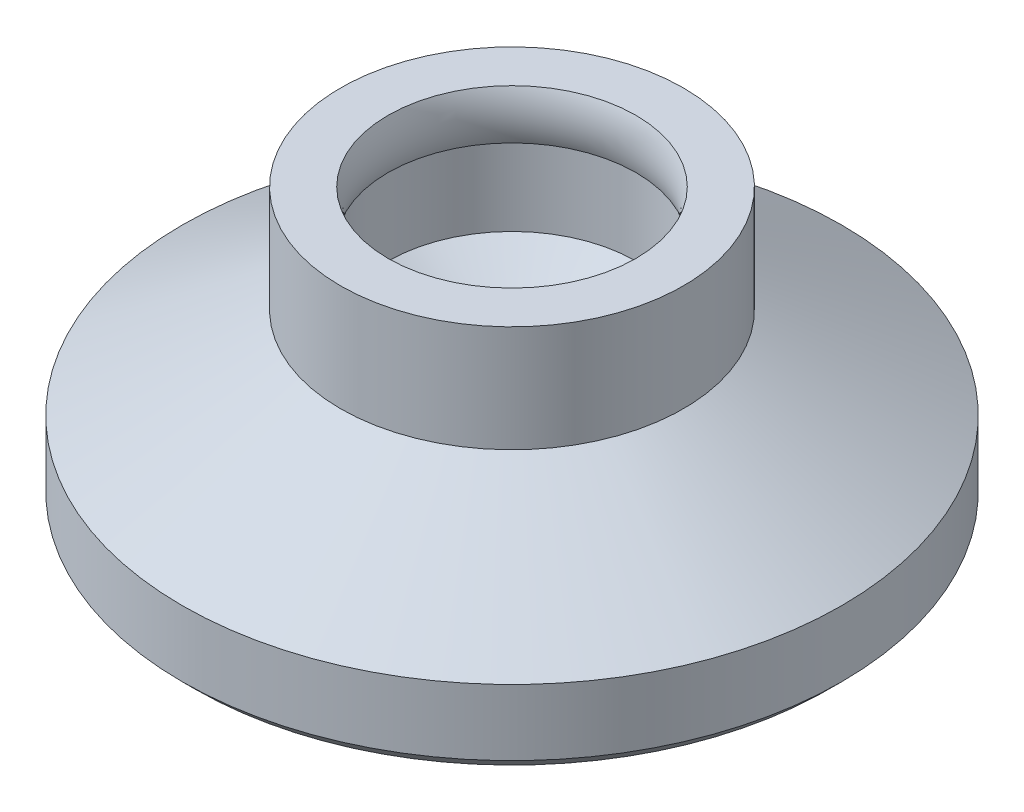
from build123d import *

# Parameters (mm, degrees)
SKETCH1_R      = 6.5
EXTRUDE1_DEPTH = 5.25
SKETCH3_R      = 12.5
EXTRUDE2_DEPTH = 3
CHAMFER1_SIZE  = 0.5


with BuildPart() as part:
    # Sketch1 → Extrude1 (new, symmetric)
    with BuildSketch(Plane(origin=(0, 0, 0), x_dir=(1, 0, 0), z_dir=(0, 1, 0))):
        with Locations(Location((0, 0, 0), (0, 0, 90))):
            Circle(SKETCH1_R)
    extrude(amount=EXTRUDE1_DEPTH, both=True)

    # Sketch3 → Extrude2 (add)
    with BuildSketch(Plane.XZ.offset(5.25)):
        with Locations(Location((0, 0, 0), (0, 0, 270))):
            Circle(SKETCH3_R)
    extrude(amount=-EXTRUDE2_DEPTH)

    # Sketch4 → Revolve1 (revolve)
    with BuildSketch(Plane.XY, mode=Mode.PRIVATE) as revolve1_sk:
        Polygon((-12.5, -2.25), (-6.5, 1.214101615), (-6.5, -2.25), align=None)
    revolve(revolve1_sk.sketch.rotate(Axis((0, 5.25, 0), (0, -1, 0)), 90), axis=Axis((0, 5.25, 0), (0, -1, 0)))

    # Chamfer1
    chamfer1_edges = [part.edges().sort_by_distance(p)[0] for p in [
        (0, -5.25, 12.5),
    ]]
    chamfer(chamfer1_edges, length=CHAMFER1_SIZE)

    # Sketch5 → Cut-Revolve1 (revolve, cut)
    with BuildSketch(Plane.XY, mode=Mode.PRIVATE) as cut_revolve1_sk:
        with BuildLine():
            Line((0, 5.25), (4.7, 5.25))
            ThreePointArc((4.7, 5.25), (4.512, 4.31), (4.7, 3.37))
            Line((4.7, 3.37), (4.7, 0.463546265))
            Line((4.7, 0.463546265), (0, -2.25))
            Line((0, -2.25), (0, 5.25))
        make_face()
    revolve(cut_revolve1_sk.sketch.rotate(Axis((0, 0, 0), (0, 1, 0)), 270), axis=Axis((0, 0, 0), (0, 1, 0)), mode=Mode.SUBTRACT)


solid = part.part
